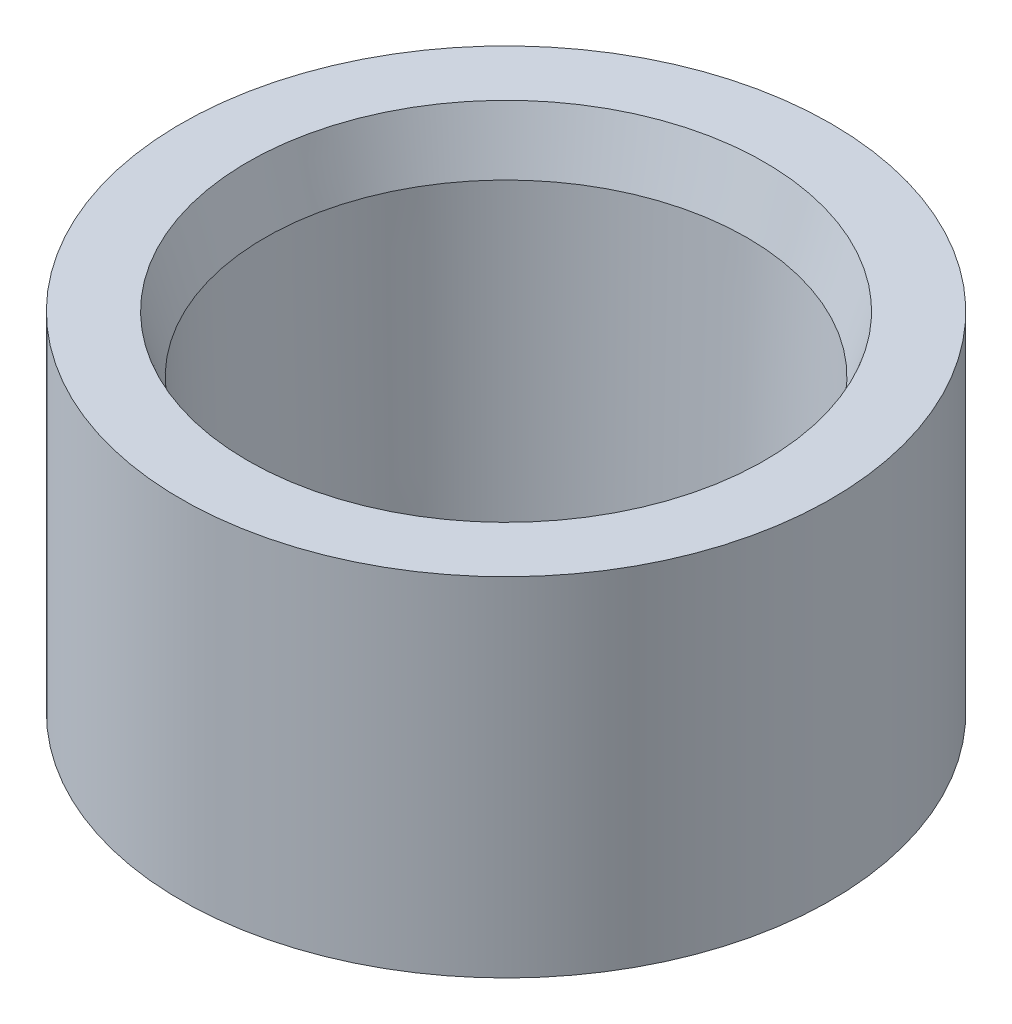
from build123d import *

# Parameters (mm, degrees)
CHAMFER1_SIZE  = 11.43
CHAMFER1_SIZE2 = 3.094764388


with BuildPart() as part:
    # Sketch1 → Revolve1 (revolve)
    with BuildSketch(Plane.XY, mode=Mode.PRIVATE) as revolve1_sk:
        Polygon((46.4312, 0), (48.9712, 70), (65.4812, 70), (65.4812, 0), align=None)
    revolve(revolve1_sk.sketch.rotate(Axis((0, 0, 0), (0, 1, 0)), 90), axis=Axis((0, 0, 0), (0, 1, 0)))

    # Chamfer1
    chamfer1_edges = [part.edges().sort_by_distance(p)[0] for p in [
        (0, 70, 48.9712),
    ]]
    chamfer1_side = [part.faces().sort_by_distance(p)[0] for p in [
        (0, 35, 47.7012),
    ]]
    chamfer(chamfer1_edges, length=CHAMFER1_SIZE, length2=CHAMFER1_SIZE2, reference=chamfer1_side[0])


solid = part.part
